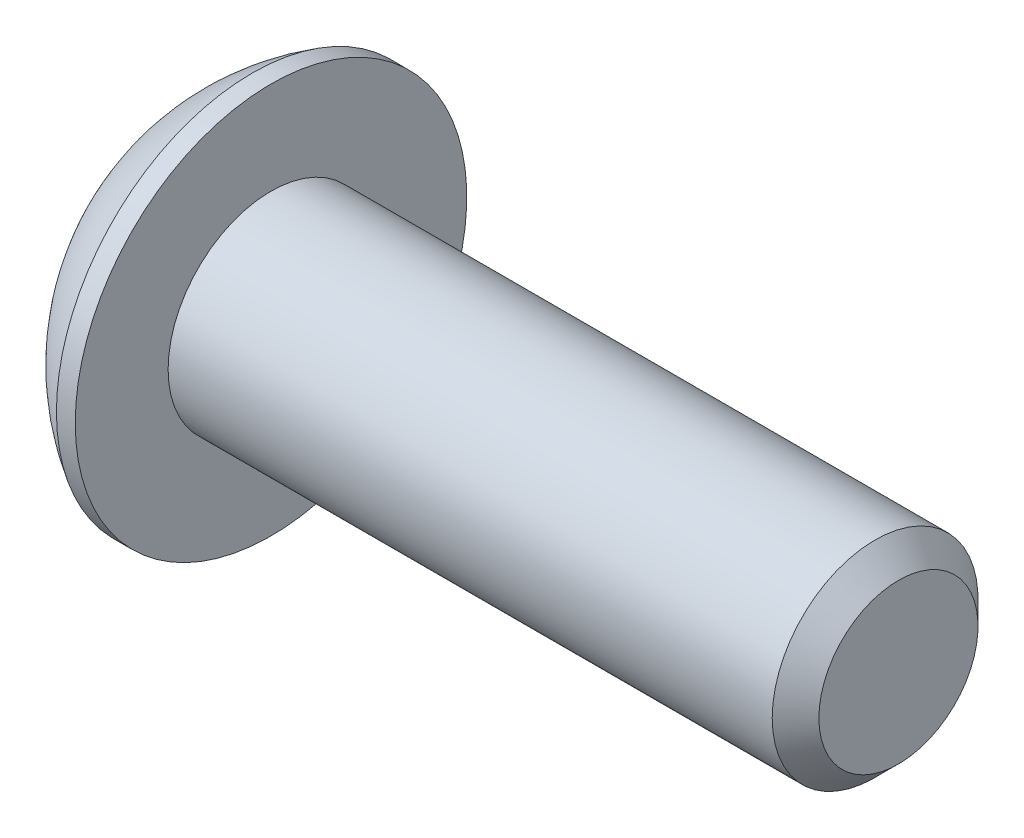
ISO-10303-21;
HEADER;
FILE_DESCRIPTION(('STEP AP214'),'2;1');
FILE_NAME('part.step','',(''),(''),'','','');
FILE_SCHEMA(('AUTOMOTIVE_DESIGN { 1 0 10303 214 1 1 1 1 }'));
ENDSEC;
DATA;
#1=APPLICATION_CONTEXT('core data for automotive mechanical design processes');
#2=APPLICATION_PROTOCOL_DEFINITION('international standard','automotive_design',2000,#1);
#3=PRODUCT_CONTEXT('',#1,'mechanical');
#4=PRODUCT('Part','Part','',(#3));
#5=PRODUCT_RELATED_PRODUCT_CATEGORY('part','',(#4));
#6=PRODUCT_DEFINITION_FORMATION('','',#4);
#7=PRODUCT_DEFINITION_CONTEXT('part definition',#1,'design');
#8=PRODUCT_DEFINITION('design','',#6,#7);
#9=PRODUCT_DEFINITION_SHAPE('','',#8);
#10=(LENGTH_UNIT() NAMED_UNIT(*) SI_UNIT(.MILLI.,.METRE.));
#11=(NAMED_UNIT(*) PLANE_ANGLE_UNIT() SI_UNIT($,.RADIAN.));
#12=(NAMED_UNIT(*) SI_UNIT($,.STERADIAN.) SOLID_ANGLE_UNIT());
#13=UNCERTAINTY_MEASURE_WITH_UNIT(LENGTH_MEASURE(1.E-05),#10,'distance_accuracy_value','');
#14=(GEOMETRIC_REPRESENTATION_CONTEXT(3) GLOBAL_UNCERTAINTY_ASSIGNED_CONTEXT((#13)) GLOBAL_UNIT_ASSIGNED_CONTEXT((#10,
#11,#12)) REPRESENTATION_CONTEXT('',''));
#15=CARTESIAN_POINT('',(0.,0.,0.));
#16=DIRECTION('',(0.,0.,1.));
#17=DIRECTION('',(1.,0.,0.));
#18=AXIS2_PLACEMENT_3D('',#15,#16,#17);
#19=CARTESIAN_POINT('',(0.,0.,0.));
#20=DIRECTION('',(-1.,0.,0.));
#21=DIRECTION('',(0.,0.,1.));
#22=AXIS2_PLACEMENT_3D('',#19,#20,#21);
#23=PLANE('',#22);
#24=CARTESIAN_POINT('',(0.,0.,0.));
#25=DIRECTION('',(-1.,0.,0.));
#26=DIRECTION('',(0.,0.,1.));
#27=AXIS2_PLACEMENT_3D('',#24,#25,#26);
#28=CIRCLE('',#27,1.9812);
#29=CARTESIAN_POINT('',(0.,1.9812,0.));
#30=VERTEX_POINT('',#29);
#31=EDGE_CURVE('E11',#30,#30,#28,.T.);
#32=ORIENTED_EDGE('',*,*,#31,.T.);
#33=EDGE_LOOP('',(#32));
#34=FACE_BOUND('',#33,.T.);
#35=DIRECTION('',(0.,-1.,0.));
#36=VECTOR('',#35,1.);
#37=CARTESIAN_POINT('',(0.,-0.689240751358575,1.1938));
#38=LINE('',#37,#36);
#39=CARTESIAN_POINT('',(0.,0.689240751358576,1.1938));
#40=VERTEX_POINT('',#39);
#41=CARTESIAN_POINT('',(0.,-0.689240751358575,1.1938));
#42=VERTEX_POINT('',#41);
#43=EDGE_CURVE('E47',#40,#42,#38,.T.);
#44=ORIENTED_EDGE('',*,*,#43,.T.);
#45=DIRECTION('',(0.,-0.5,-0.866025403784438));
#46=VECTOR('',#45,1.);
#47=CARTESIAN_POINT('',(0.,-1.37848150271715,0.));
#48=LINE('',#47,#46);
#49=CARTESIAN_POINT('',(0.,-1.37848150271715,0.));
#50=VERTEX_POINT('',#49);
#51=EDGE_CURVE('E363',#42,#50,#48,.T.);
#52=ORIENTED_EDGE('',*,*,#51,.T.);
#53=DIRECTION('',(0.,0.5,-0.866025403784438));
#54=VECTOR('',#53,1.);
#55=CARTESIAN_POINT('',(0.,-0.689240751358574,-1.1938));
#56=LINE('',#55,#54);
#57=CARTESIAN_POINT('',(0.,-0.689240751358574,-1.1938));
#58=VERTEX_POINT('',#57);
#59=EDGE_CURVE('E127',#50,#58,#56,.T.);
#60=ORIENTED_EDGE('',*,*,#59,.T.);
#61=DIRECTION('',(0.,1.,0.));
#62=VECTOR('',#61,1.);
#63=CARTESIAN_POINT('',(0.,0.689240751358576,-1.1938));
#64=LINE('',#63,#62);
#65=CARTESIAN_POINT('',(0.,0.689240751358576,-1.1938));
#66=VERTEX_POINT('',#65);
#67=EDGE_CURVE('E366',#58,#66,#64,.T.);
#68=ORIENTED_EDGE('',*,*,#67,.T.);
#69=DIRECTION('',(0.,0.5,0.866025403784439));
#70=VECTOR('',#69,1.);
#71=CARTESIAN_POINT('',(0.,1.37848150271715,0.));
#72=LINE('',#71,#70);
#73=CARTESIAN_POINT('',(0.,1.37848150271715,0.));
#74=VERTEX_POINT('',#73);
#75=EDGE_CURVE('E368',#66,#74,#72,.T.);
#76=ORIENTED_EDGE('',*,*,#75,.T.);
#77=DIRECTION('',(0.,-0.5,0.866025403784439));
#78=VECTOR('',#77,1.);
#79=CARTESIAN_POINT('',(0.,0.689240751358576,1.1938));
#80=LINE('',#79,#78);
#81=EDGE_CURVE('E370',#74,#40,#80,.T.);
#82=ORIENTED_EDGE('',*,*,#81,.T.);
#83=EDGE_LOOP('',(#44,#52,#60,#68,#76,#82));
#84=FACE_BOUND('',#83,.T.);
#85=ADVANCED_FACE('F33',(#34,#84),#23,.T.);
#86=CARTESIAN_POINT('',(4.13385,0.,0.));
#87=DIRECTION('',(-1.,0.,0.));
#88=DIRECTION('',(0.,1.,0.));
#89=AXIS2_PLACEMENT_3D('',#86,#87,#88);
#90=SPHERICAL_SURFACE('',#89,4.58408870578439);
#91=CARTESIAN_POINT('',(1.8288,0.,0.));
#92=DIRECTION('',(-1.,0.,0.));
#93=DIRECTION('',(0.,0.,1.));
#94=AXIS2_PLACEMENT_3D('',#91,#92,#93);
#95=CIRCLE('',#94,3.9624);
#96=CARTESIAN_POINT('',(1.8288,3.9624,0.));
#97=VERTEX_POINT('',#96);
#98=EDGE_CURVE('E40',#97,#97,#95,.T.);
#99=CARTESIAN_POINT('',(1.8288,3.9624,0.));
#100=CARTESIAN_POINT('',(1.80415889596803,3.94806555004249,0.));
#101=CARTESIAN_POINT('',(1.77965153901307,3.93350118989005,0.));
#102=CARTESIAN_POINT('',(1.73091277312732,3.90391784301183,0.));
#103=CARTESIAN_POINT('',(1.70668136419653,3.88889885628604,0.));
#104=CARTESIAN_POINT('',(1.65850294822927,3.85841145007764,0.));
#105=CARTESIAN_POINT('',(1.63455594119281,3.84294303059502,0.));
#106=CARTESIAN_POINT('',(1.58695465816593,3.8115621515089,0.));
#107=CARTESIAN_POINT('',(1.56330038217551,3.79564969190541,0.));
#108=CARTESIAN_POINT('',(1.51629279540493,3.76338626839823,0.));
#109=CARTESIAN_POINT('',(1.49293948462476,3.74703530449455,0.));
#110=CARTESIAN_POINT('',(1.44654195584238,3.71390056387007,0.));
#111=CARTESIAN_POINT('',(1.42349773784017,3.69711678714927,0.));
#112=CARTESIAN_POINT('',(1.37772641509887,3.66312226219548,0.));
#113=CARTESIAN_POINT('',(1.35499931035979,3.6459115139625,0.));
#114=CARTESIAN_POINT('',(1.30987012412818,3.61106903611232,0.));
#115=CARTESIAN_POINT('',(1.28746804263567,3.59343730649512,0.));
#116=CARTESIAN_POINT('',(1.2429966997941,3.55775900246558,0.));
#117=CARTESIAN_POINT('',(1.22092743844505,3.53971242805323,0.));
#118=CARTESIAN_POINT('',(1.17712941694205,3.50321071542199,0.));
#119=CARTESIAN_POINT('',(1.1554006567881,3.48475557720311,0.));
#120=CARTESIAN_POINT('',(1.11229120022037,3.44744316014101,0.));
#121=CARTESIAN_POINT('',(1.0909105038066,3.42858588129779,0.));
#122=CARTESIAN_POINT('',(1.04850461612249,3.39047574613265,0.));
#123=CARTESIAN_POINT('',(1.02747942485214,3.37122288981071,0.));
#124=CARTESIAN_POINT('',(0.985791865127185,3.33232830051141,0.));
#125=CARTESIAN_POINT('',(0.965129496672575,3.31268656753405,0.));
#126=CARTESIAN_POINT('',(0.924174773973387,3.27302106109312,0.));
#127=CARTESIAN_POINT('',(0.903882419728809,3.25299728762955,0.));
#128=CARTESIAN_POINT('',(0.863674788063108,3.21257466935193,0.));
#129=CARTESIAN_POINT('',(0.843759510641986,3.19217582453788,0.));
#130=CARTESIAN_POINT('',(0.804312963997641,3.15101016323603,0.));
#131=CARTESIAN_POINT('',(0.784781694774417,3.13024334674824,0.));
#132=CARTESIAN_POINT('',(0.746109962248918,3.08834896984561,0.));
#133=CARTESIAN_POINT('',(0.726969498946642,3.06722140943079,0.));
#134=CARTESIAN_POINT('',(0.68908603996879,3.02461289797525,0.));
#135=CARTESIAN_POINT('',(0.670343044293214,3.00313194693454,0.));
#136=CARTESIAN_POINT('',(0.63326104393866,2.95982413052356,0.));
#137=CARTESIAN_POINT('',(0.614922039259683,2.93799726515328,0.));
#138=CARTESIAN_POINT('',(0.578654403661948,2.89400521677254,0.));
#139=CARTESIAN_POINT('',(0.560725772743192,2.87184003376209,0.));
#140=CARTESIAN_POINT('',(0.525285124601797,2.8271790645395,0.));
#141=CARTESIAN_POINT('',(0.50777310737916,2.80468327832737,0.));
#142=CARTESIAN_POINT('',(0.473171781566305,2.75936893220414,0.));
#143=CARTESIAN_POINT('',(0.456082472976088,2.73655037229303,0.));
#144=CARTESIAN_POINT('',(0.422332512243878,2.69059842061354,0.));
#145=CARTESIAN_POINT('',(0.405671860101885,2.66746502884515,0.));
#146=CARTESIAN_POINT('',(0.372785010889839,2.62089146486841,0.));
#147=CARTESIAN_POINT('',(0.356558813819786,2.59745129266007,0.));
#148=CARTESIAN_POINT('',(0.324546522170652,2.55027232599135,0.));
#149=CARTESIAN_POINT('',(0.308760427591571,2.52653353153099,0.));
#150=CARTESIAN_POINT('',(0.277633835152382,2.47876558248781,0.));
#151=CARTESIAN_POINT('',(0.262293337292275,2.454736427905,0.));
#152=CARTESIAN_POINT('',(0.232063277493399,2.40639612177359,0.));
#153=CARTESIAN_POINT('',(0.21717371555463,2.382084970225,0.));
#154=CARTESIAN_POINT('',(0.187850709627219,2.33318913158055,0.));
#155=CARTESIAN_POINT('',(0.173417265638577,2.30860444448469,0.));
#156=CARTESIAN_POINT('',(0.14501151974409,2.25917009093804,0.));
#157=CARTESIAN_POINT('',(0.131039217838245,2.23432042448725,0.));
#158=CARTESIAN_POINT('',(0.103560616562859,2.18436476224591,0.));
#159=CARTESIAN_POINT('',(0.0900543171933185,2.15925876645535,0.));
#160=CARTESIAN_POINT('',(0.0635124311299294,2.10879917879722,0.));
#161=CARTESIAN_POINT('',(0.0504768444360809,2.08344558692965,0.));
#162=CARTESIAN_POINT('',(0.024880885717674,2.03249964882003,0.));
#163=CARTESIAN_POINT('',(0.0123205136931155,2.00690730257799,0.));
#164=CARTESIAN_POINT('',(0.,1.9812,0.));
#165=B_SPLINE_CURVE_WITH_KNOTS('',3,(#99,#100,#101,#102,#103,#104,#105,#106,#107,#108,#109,#110,
#111,#112,#113,#114,#115,#116,#117,#118,#119,#120,#121,#122,#123,#124,#125,#126,#127,#128,#129,
#130,#131,#132,#133,#134,#135,#136,#137,#138,#139,#140,#141,#142,#143,#144,#145,#146,#147,#148,
#149,#150,#151,#152,#153,#154,#155,#156,#157,#158,#159,#160,#161,#162,#163,#164),.UNSPECIFIED.,
.F.,.F.,(4,2,2,2,2,2,2,2,2,2,2,2,2,2,2,2,2,2,2,2,2,2,2,2,2,2,2,2,2,2,2,2,4),(0.,
0.0855203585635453,0.17104071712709,0.256561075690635,0.342081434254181,0.427601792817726,
0.513122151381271,0.598642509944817,0.684162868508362,0.769683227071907,0.855203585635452,
0.940723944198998,1.02624430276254,1.11176466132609,1.19728501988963,1.28280537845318,
1.36832573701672,1.45384609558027,1.53936645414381,1.62488681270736,1.7104071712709,
1.79592752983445,1.88144788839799,1.96696824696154,2.05248860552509,2.13800896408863,
2.22352932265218,2.30904968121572,2.39457003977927,2.48009039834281,2.56561075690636,
2.6511311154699,2.73665147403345),.UNSPECIFIED.);
#166=EDGE_CURVE('BSEAM154',#97,#30,#165,.T.);
#167=ORIENTED_EDGE('',*,*,#98,.T.);
#168=ORIENTED_EDGE('',*,*,#31,.F.);
#169=ORIENTED_EDGE('',*,*,#166,.T.);
#170=ORIENTED_EDGE('',*,*,#166,.F.);
#171=EDGE_LOOP('',(#167,#169,#168,#170));
#172=FACE_BOUND('',#171,.T.);
#173=ADVANCED_FACE('F154',(#172),#90,.T.);
#174=CARTESIAN_POINT('',(0.,0.,0.));
#175=DIRECTION('',(-1.,0.,0.));
#176=DIRECTION('',(0.,0.,1.));
#177=AXIS2_PLACEMENT_3D('',#174,#175,#176);
#178=CYLINDRICAL_SURFACE('',#177,3.9624);
#179=ORIENTED_EDGE('',*,*,#98,.F.);
#180=EDGE_LOOP('',(#179));
#181=FACE_BOUND('',#180,.T.);
#182=CARTESIAN_POINT('',(2.2098,0.,0.));
#183=DIRECTION('',(-1.,0.,0.));
#184=DIRECTION('',(0.,0.,1.));
#185=AXIS2_PLACEMENT_3D('',#182,#183,#184);
#186=CIRCLE('',#185,3.9624);
#187=CARTESIAN_POINT('',(2.2098,0.,3.9624));
#188=VERTEX_POINT('',#187);
#189=EDGE_CURVE('E149',#188,#188,#186,.T.);
#190=ORIENTED_EDGE('',*,*,#189,.T.);
#191=EDGE_LOOP('',(#190));
#192=FACE_BOUND('',#191,.T.);
#193=ADVANCED_FACE('F157',(#181,#192),#178,.T.);
#194=CARTESIAN_POINT('',(2.2098,2.0828,0.));
#195=DIRECTION('',(-1.,0.,0.));
#196=DIRECTION('',(0.,0.,1.));
#197=AXIS2_PLACEMENT_3D('',#194,#195,#196);
#198=PLANE('',#197);
#199=ORIENTED_EDGE('',*,*,#189,.F.);
#200=EDGE_LOOP('',(#199));
#201=FACE_BOUND('',#200,.T.);
#202=CARTESIAN_POINT('',(2.2098,0.,0.));
#203=DIRECTION('',(-1.,0.,0.));
#204=DIRECTION('',(0.,0.,1.));
#205=AXIS2_PLACEMENT_3D('',#202,#203,#204);
#206=CIRCLE('',#205,2.0828);
#207=CARTESIAN_POINT('',(2.2098,0.,2.0828));
#208=VERTEX_POINT('',#207);
#209=EDGE_CURVE('E146',#208,#208,#206,.T.);
#210=ORIENTED_EDGE('',*,*,#209,.T.);
#211=EDGE_LOOP('',(#210));
#212=FACE_BOUND('',#211,.T.);
#213=ADVANCED_FACE('F160',(#201,#212),#198,.F.);
#214=CARTESIAN_POINT('',(0.,0.,0.));
#215=DIRECTION('',(-1.,0.,0.));
#216=DIRECTION('',(0.,0.,1.));
#217=AXIS2_PLACEMENT_3D('',#214,#215,#216);
#218=CYLINDRICAL_SURFACE('',#217,2.0828);
#219=ORIENTED_EDGE('',*,*,#209,.F.);
#220=EDGE_LOOP('',(#219));
#221=FACE_BOUND('',#220,.T.);
#222=CARTESIAN_POINT('',(14.43736,0.,0.));
#223=DIRECTION('',(-1.,0.,0.));
#224=DIRECTION('',(0.,0.,1.));
#225=AXIS2_PLACEMENT_3D('',#222,#223,#224);
#226=CIRCLE('',#225,2.0828);
#227=CARTESIAN_POINT('',(14.43736,0.,2.0828));
#228=VERTEX_POINT('',#227);
#229=EDGE_CURVE('E143',#228,#228,#226,.T.);
#230=ORIENTED_EDGE('',*,*,#229,.T.);
#231=EDGE_LOOP('',(#230));
#232=FACE_BOUND('',#231,.T.);
#233=ADVANCED_FACE('F166',(#221,#232),#218,.T.);
#234=CARTESIAN_POINT('',(14.9098,0.,0.));
#235=DIRECTION('',(-1.,0.,0.));
#236=DIRECTION('',(0.,0.,1.));
#237=AXIS2_PLACEMENT_3D('',#234,#235,#236);
#238=CONICAL_SURFACE('',#237,1.61036,0.785398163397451);
#239=ORIENTED_EDGE('',*,*,#229,.F.);
#240=EDGE_LOOP('',(#239));
#241=FACE_BOUND('',#240,.T.);
#242=CARTESIAN_POINT('',(14.9098,0.,0.));
#243=DIRECTION('',(-1.,0.,0.));
#244=DIRECTION('',(0.,0.,1.));
#245=AXIS2_PLACEMENT_3D('',#242,#243,#244);
#246=CIRCLE('',#245,1.61036);
#247=CARTESIAN_POINT('',(14.9098,0.,1.61036));
#248=VERTEX_POINT('',#247);
#249=EDGE_CURVE('E139',#248,#248,#246,.T.);
#250=ORIENTED_EDGE('',*,*,#249,.T.);
#251=EDGE_LOOP('',(#250));
#252=FACE_BOUND('',#251,.T.);
#253=ADVANCED_FACE('F172',(#241,#252),#238,.T.);
#254=CARTESIAN_POINT('',(14.9098,0.,0.));
#255=DIRECTION('',(-1.,0.,0.));
#256=DIRECTION('',(0.,0.,1.));
#257=AXIS2_PLACEMENT_3D('',#254,#255,#256);
#258=PLANE('',#257);
#259=ORIENTED_EDGE('',*,*,#249,.F.);
#260=EDGE_LOOP('',(#259));
#261=FACE_BOUND('',#260,.T.);
#262=ADVANCED_FACE('F178',(#261),#258,.F.);
#263=CARTESIAN_POINT('',(1.3208,-1.37848150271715,0.));
#264=DIRECTION('',(0.,0.866025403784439,-0.5));
#265=DIRECTION('',(0.,0.5,0.866025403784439));
#266=AXIS2_PLACEMENT_3D('',#263,#264,#265);
#267=PLANE('',#266);
#268=DIRECTION('',(0.,-0.5,-0.866025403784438));
#269=VECTOR('',#268,1.);
#270=CARTESIAN_POINT('',(1.3208,-1.37848150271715,0.));
#271=LINE('',#270,#269);
#272=CARTESIAN_POINT('',(1.3208,-0.689240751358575,1.1938));
#273=VERTEX_POINT('',#272);
#274=CARTESIAN_POINT('',(1.3208,-1.03386112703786,0.5969));
#275=VERTEX_POINT('',#274);
#276=EDGE_CURVE('E113',#273,#275,#271,.T.);
#277=ORIENTED_EDGE('',*,*,#276,.T.);
#278=CARTESIAN_POINT('',(1.3208,-1.37848150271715,0.));
#279=VERTEX_POINT('',#278);
#280=EDGE_CURVE('E108',#275,#279,#271,.T.);
#281=ORIENTED_EDGE('',*,*,#280,.T.);
#282=DIRECTION('',(-1.,0.,0.));
#283=VECTOR('',#282,1.);
#284=CARTESIAN_POINT('',(1.3208,-1.37848150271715,0.));
#285=LINE('',#284,#283);
#286=EDGE_CURVE('E110',#279,#50,#285,.T.);
#287=ORIENTED_EDGE('',*,*,#286,.T.);
#288=ORIENTED_EDGE('',*,*,#51,.F.);
#289=DIRECTION('',(-1.,0.,0.));
#290=VECTOR('',#289,1.);
#291=CARTESIAN_POINT('',(1.3208,-0.689240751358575,1.1938));
#292=LINE('',#291,#290);
#293=EDGE_CURVE('E358',#273,#42,#292,.T.);
#294=ORIENTED_EDGE('',*,*,#293,.F.);
#295=EDGE_LOOP('',(#277,#281,#287,#288,#294));
#296=FACE_BOUND('',#295,.T.);
#297=ADVANCED_FACE('F109',(#296),#267,.T.);
#298=CARTESIAN_POINT('',(1.3208,-0.689240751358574,-1.1938));
#299=DIRECTION('',(0.,0.866025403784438,0.5));
#300=DIRECTION('',(0.,-0.5,0.866025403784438));
#301=AXIS2_PLACEMENT_3D('',#298,#299,#300);
#302=PLANE('',#301);
#303=DIRECTION('',(0.,0.5,-0.866025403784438));
#304=VECTOR('',#303,1.);
#305=CARTESIAN_POINT('',(1.3208,-0.689240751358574,-1.1938));
#306=LINE('',#305,#304);
#307=CARTESIAN_POINT('',(1.3208,-1.03386112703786,-0.596900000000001));
#308=VERTEX_POINT('',#307);
#309=EDGE_CURVE('E55',#279,#308,#306,.T.);
#310=ORIENTED_EDGE('',*,*,#309,.T.);
#311=CARTESIAN_POINT('',(1.3208,-0.689240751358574,-1.1938));
#312=VERTEX_POINT('',#311);
#313=EDGE_CURVE('E122',#308,#312,#306,.T.);
#314=ORIENTED_EDGE('',*,*,#313,.T.);
#315=DIRECTION('',(-1.,0.,0.));
#316=VECTOR('',#315,1.);
#317=CARTESIAN_POINT('',(1.3208,-0.689240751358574,-1.1938));
#318=LINE('',#317,#316);
#319=EDGE_CURVE('E129',#312,#58,#318,.T.);
#320=ORIENTED_EDGE('',*,*,#319,.T.);
#321=ORIENTED_EDGE('',*,*,#59,.F.);
#322=ORIENTED_EDGE('',*,*,#286,.F.);
#323=EDGE_LOOP('',(#310,#314,#320,#321,#322));
#324=FACE_BOUND('',#323,.T.);
#325=ADVANCED_FACE('F125',(#324),#302,.T.);
#326=CARTESIAN_POINT('',(1.3208,0.689240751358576,-1.1938));
#327=DIRECTION('',(0.,0.,1.));
#328=DIRECTION('',(0.,-1.,0.));
#329=AXIS2_PLACEMENT_3D('',#326,#327,#328);
#330=PLANE('',#329);
#331=DIRECTION('',(0.,1.,0.));
#332=VECTOR('',#331,1.);
#333=CARTESIAN_POINT('',(1.3208,0.689240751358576,-1.1938));
#334=LINE('',#333,#332);
#335=CARTESIAN_POINT('',(1.3208,0.,-1.1938));
#336=VERTEX_POINT('',#335);
#337=EDGE_CURVE('E388',#312,#336,#334,.T.);
#338=ORIENTED_EDGE('',*,*,#337,.T.);
#339=CARTESIAN_POINT('',(1.3208,0.689240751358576,-1.1938));
#340=VERTEX_POINT('',#339);
#341=EDGE_CURVE('E121',#336,#340,#334,.T.);
#342=ORIENTED_EDGE('',*,*,#341,.T.);
#343=DIRECTION('',(-1.,0.,0.));
#344=VECTOR('',#343,1.);
#345=CARTESIAN_POINT('',(1.3208,0.689240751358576,-1.1938));
#346=LINE('',#345,#344);
#347=EDGE_CURVE('E134',#340,#66,#346,.T.);
#348=ORIENTED_EDGE('',*,*,#347,.T.);
#349=ORIENTED_EDGE('',*,*,#67,.F.);
#350=ORIENTED_EDGE('',*,*,#319,.F.);
#351=EDGE_LOOP('',(#338,#342,#348,#349,#350));
#352=FACE_BOUND('',#351,.T.);
#353=ADVANCED_FACE('F237',(#352),#330,.T.);
#354=CARTESIAN_POINT('',(1.3208,1.37848150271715,0.));
#355=DIRECTION('',(0.,-0.866025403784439,0.5));
#356=DIRECTION('',(0.,-0.5,-0.866025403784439));
#357=AXIS2_PLACEMENT_3D('',#354,#355,#356);
#358=PLANE('',#357);
#359=DIRECTION('',(0.,0.5,0.866025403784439));
#360=VECTOR('',#359,1.);
#361=CARTESIAN_POINT('',(1.3208,1.37848150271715,0.));
#362=LINE('',#361,#360);
#363=CARTESIAN_POINT('',(1.3208,1.03386112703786,-0.596900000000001));
#364=VERTEX_POINT('',#363);
#365=EDGE_CURVE('E392',#340,#364,#362,.T.);
#366=ORIENTED_EDGE('',*,*,#365,.T.);
#367=CARTESIAN_POINT('',(1.3208,1.37848150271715,0.));
#368=VERTEX_POINT('',#367);
#369=EDGE_CURVE('E390',#364,#368,#362,.T.);
#370=ORIENTED_EDGE('',*,*,#369,.T.);
#371=DIRECTION('',(-1.,0.,0.));
#372=VECTOR('',#371,1.);
#373=CARTESIAN_POINT('',(1.3208,1.37848150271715,0.));
#374=LINE('',#373,#372);
#375=EDGE_CURVE('E374',#368,#74,#374,.T.);
#376=ORIENTED_EDGE('',*,*,#375,.T.);
#377=ORIENTED_EDGE('',*,*,#75,.F.);
#378=ORIENTED_EDGE('',*,*,#347,.F.);
#379=EDGE_LOOP('',(#366,#370,#376,#377,#378));
#380=FACE_BOUND('',#379,.T.);
#381=ADVANCED_FACE('F246',(#380),#358,.T.);
#382=CARTESIAN_POINT('',(1.3208,0.689240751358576,1.1938));
#383=DIRECTION('',(0.,-0.866025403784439,-0.5));
#384=DIRECTION('',(0.,0.5,-0.866025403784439));
#385=AXIS2_PLACEMENT_3D('',#382,#383,#384);
#386=PLANE('',#385);
#387=DIRECTION('',(0.,-0.5,0.866025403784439));
#388=VECTOR('',#387,1.);
#389=CARTESIAN_POINT('',(1.3208,0.689240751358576,1.1938));
#390=LINE('',#389,#388);
#391=CARTESIAN_POINT('',(1.3208,1.03386112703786,0.596900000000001));
#392=VERTEX_POINT('',#391);
#393=EDGE_CURVE('E353',#368,#392,#390,.T.);
#394=ORIENTED_EDGE('',*,*,#393,.T.);
#395=CARTESIAN_POINT('',(1.3208,0.689240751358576,1.1938));
#396=VERTEX_POINT('',#395);
#397=EDGE_CURVE('E349',#392,#396,#390,.T.);
#398=ORIENTED_EDGE('',*,*,#397,.T.);
#399=DIRECTION('',(-1.,0.,0.));
#400=VECTOR('',#399,1.);
#401=CARTESIAN_POINT('',(1.3208,0.689240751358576,1.1938));
#402=LINE('',#401,#400);
#403=EDGE_CURVE('E357',#396,#40,#402,.T.);
#404=ORIENTED_EDGE('',*,*,#403,.T.);
#405=ORIENTED_EDGE('',*,*,#81,.F.);
#406=ORIENTED_EDGE('',*,*,#375,.F.);
#407=EDGE_LOOP('',(#394,#398,#404,#405,#406));
#408=FACE_BOUND('',#407,.T.);
#409=ADVANCED_FACE('F256',(#408),#386,.T.);
#410=CARTESIAN_POINT('',(1.3208,-0.689240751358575,1.1938));
#411=DIRECTION('',(0.,0.,-1.));
#412=DIRECTION('',(0.,1.,0.));
#413=AXIS2_PLACEMENT_3D('',#410,#411,#412);
#414=PLANE('',#413);
#415=DIRECTION('',(0.,-1.,0.));
#416=VECTOR('',#415,1.);
#417=CARTESIAN_POINT('',(1.3208,-0.689240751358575,1.1938));
#418=LINE('',#417,#416);
#419=CARTESIAN_POINT('',(1.3208,0.,1.1938));
#420=VERTEX_POINT('',#419);
#421=EDGE_CURVE('E348',#396,#420,#418,.T.);
#422=ORIENTED_EDGE('',*,*,#421,.T.);
#423=EDGE_CURVE('E351',#420,#273,#418,.T.);
#424=ORIENTED_EDGE('',*,*,#423,.T.);
#425=ORIENTED_EDGE('',*,*,#293,.T.);
#426=ORIENTED_EDGE('',*,*,#43,.F.);
#427=ORIENTED_EDGE('',*,*,#403,.F.);
#428=EDGE_LOOP('',(#422,#424,#425,#426,#427));
#429=FACE_BOUND('',#428,.T.);
#430=ADVANCED_FACE('F266',(#429),#414,.T.);
#431=CARTESIAN_POINT('',(1.3208,-1.37848150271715,0.));
#432=DIRECTION('',(1.,0.,0.));
#433=DIRECTION('',(0.,0.,-1.));
#434=AXIS2_PLACEMENT_3D('',#431,#432,#433);
#435=PLANE('',#434);
#436=CARTESIAN_POINT('',(1.3208,0.,0.));
#437=DIRECTION('',(-1.,0.,0.));
#438=DIRECTION('',(0.,0.,1.));
#439=AXIS2_PLACEMENT_3D('',#436,#437,#438);
#440=CIRCLE('',#439,1.1938);
#441=EDGE_CURVE('E395',#364,#336,#440,.T.);
#442=ORIENTED_EDGE('',*,*,#441,.F.);
#443=ORIENTED_EDGE('',*,*,#365,.F.);
#444=ORIENTED_EDGE('',*,*,#341,.F.);
#445=EDGE_LOOP('',(#442,#443,#444));
#446=FACE_BOUND('',#445,.T.);
#447=ADVANCED_FACE('F276',(#446),#435,.F.);
#448=EDGE_CURVE('E140',#392,#364,#440,.T.);
#449=ORIENTED_EDGE('',*,*,#448,.F.);
#450=ORIENTED_EDGE('',*,*,#393,.F.);
#451=ORIENTED_EDGE('',*,*,#369,.F.);
#452=EDGE_LOOP('',(#449,#450,#451));
#453=FACE_BOUND('',#452,.T.);
#454=ADVANCED_FACE('F286',(#453),#435,.F.);
#455=EDGE_CURVE('E133',#420,#392,#440,.T.);
#456=ORIENTED_EDGE('',*,*,#455,.F.);
#457=ORIENTED_EDGE('',*,*,#421,.F.);
#458=ORIENTED_EDGE('',*,*,#397,.F.);
#459=EDGE_LOOP('',(#456,#457,#458));
#460=FACE_BOUND('',#459,.T.);
#461=ADVANCED_FACE('F297',(#460),#435,.F.);
#462=EDGE_CURVE('E128',#275,#420,#440,.T.);
#463=ORIENTED_EDGE('',*,*,#462,.F.);
#464=ORIENTED_EDGE('',*,*,#276,.F.);
#465=ORIENTED_EDGE('',*,*,#423,.F.);
#466=EDGE_LOOP('',(#463,#464,#465));
#467=FACE_BOUND('',#466,.T.);
#468=ADVANCED_FACE('F306',(#467),#435,.F.);
#469=EDGE_CURVE('E119',#308,#275,#440,.T.);
#470=ORIENTED_EDGE('',*,*,#469,.F.);
#471=ORIENTED_EDGE('',*,*,#309,.F.);
#472=ORIENTED_EDGE('',*,*,#280,.F.);
#473=EDGE_LOOP('',(#470,#471,#472));
#474=FACE_BOUND('',#473,.T.);
#475=ADVANCED_FACE('F118',(#474),#435,.F.);
#476=EDGE_CURVE('E389',#336,#308,#440,.T.);
#477=ORIENTED_EDGE('',*,*,#476,.F.);
#478=ORIENTED_EDGE('',*,*,#337,.F.);
#479=ORIENTED_EDGE('',*,*,#313,.F.);
#480=EDGE_LOOP('',(#477,#478,#479));
#481=FACE_BOUND('',#480,.T.);
#482=ADVANCED_FACE('F289',(#481),#435,.F.);
#483=CARTESIAN_POINT('',(2.01004075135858,0.,0.));
#484=DIRECTION('',(-1.,0.,0.));
#485=DIRECTION('',(0.,0.,1.));
#486=AXIS2_PLACEMENT_3D('',#483,#484,#485);
#487=CONICAL_SURFACE('',#486,0.,1.04719755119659);
#488=ORIENTED_EDGE('',*,*,#455,.T.);
#489=ORIENTED_EDGE('',*,*,#448,.T.);
#490=ORIENTED_EDGE('',*,*,#441,.T.);
#491=ORIENTED_EDGE('',*,*,#476,.T.);
#492=ORIENTED_EDGE('',*,*,#469,.T.);
#493=ORIENTED_EDGE('',*,*,#462,.T.);
#494=EDGE_LOOP('',(#488,#489,#490,#491,#492,#493));
#495=FACE_BOUND('',#494,.T.);
#496=CARTESIAN_POINT('',(2.01004075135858,0.,0.));
#497=VERTEX_POINT('',#496);
#498=VERTEX_LOOP('',#497);
#499=FACE_BOUND('',#498,.T.);
#500=ADVANCED_FACE('F330',(#495,#499),#487,.F.);
#501=CLOSED_SHELL('',(#85,#173,#193,#213,#233,#253,#262,#297,#325,#353,#381,#409,#430,#447,#454,
#461,#468,#475,#482,#500));
#502=MANIFOLD_SOLID_BREP('B2',#501);
#503=ADVANCED_BREP_SHAPE_REPRESENTATION('',(#18,#502),#14);
#504=SHAPE_DEFINITION_REPRESENTATION(#9,#503);
ENDSEC;
END-ISO-10303-21;
